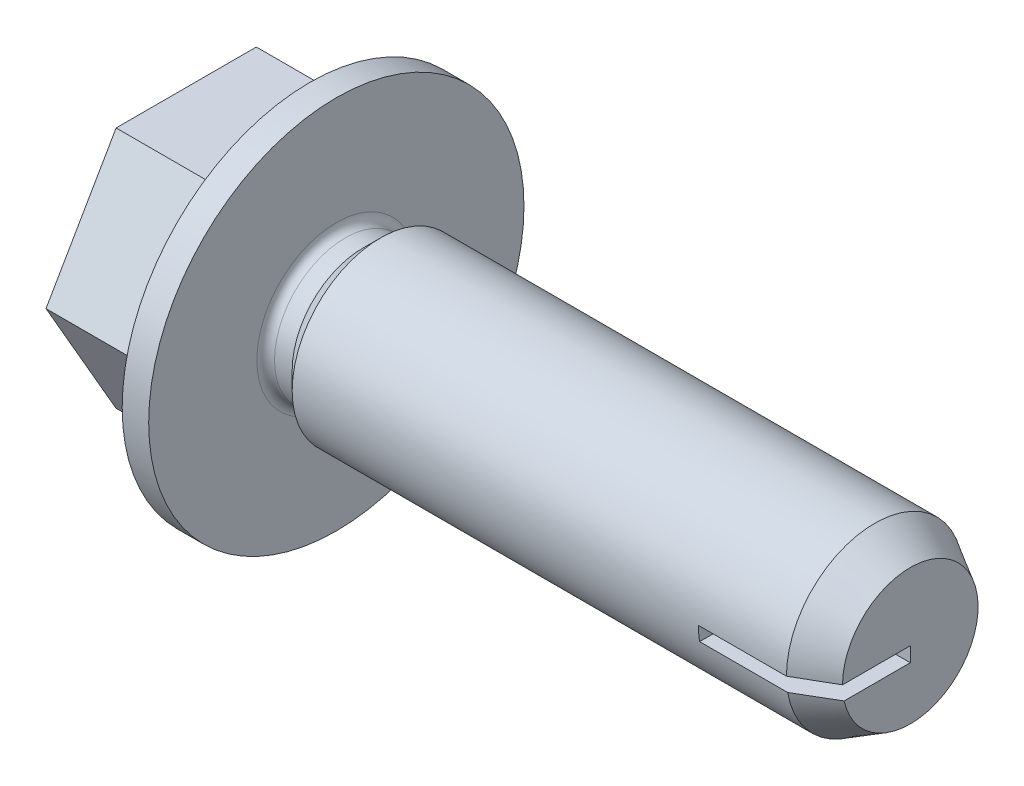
ISO-10303-21;
HEADER;
FILE_DESCRIPTION(('STEP AP214'),'2;1');
FILE_NAME('part.step','',(''),(''),'','','');
FILE_SCHEMA(('AUTOMOTIVE_DESIGN { 1 0 10303 214 1 1 1 1 }'));
ENDSEC;
DATA;
#1=APPLICATION_CONTEXT('core data for automotive mechanical design processes');
#2=APPLICATION_PROTOCOL_DEFINITION('international standard','automotive_design',2000,#1);
#3=PRODUCT_CONTEXT('',#1,'mechanical');
#4=PRODUCT('Part','Part','',(#3));
#5=PRODUCT_RELATED_PRODUCT_CATEGORY('part','',(#4));
#6=PRODUCT_DEFINITION_FORMATION('','',#4);
#7=PRODUCT_DEFINITION_CONTEXT('part definition',#1,'design');
#8=PRODUCT_DEFINITION('design','',#6,#7);
#9=PRODUCT_DEFINITION_SHAPE('','',#8);
#10=(LENGTH_UNIT() NAMED_UNIT(*) SI_UNIT(.MILLI.,.METRE.));
#11=(NAMED_UNIT(*) PLANE_ANGLE_UNIT() SI_UNIT($,.RADIAN.));
#12=(NAMED_UNIT(*) SI_UNIT($,.STERADIAN.) SOLID_ANGLE_UNIT());
#13=UNCERTAINTY_MEASURE_WITH_UNIT(LENGTH_MEASURE(1.E-05),#10,'distance_accuracy_value','');
#14=(GEOMETRIC_REPRESENTATION_CONTEXT(3) GLOBAL_UNCERTAINTY_ASSIGNED_CONTEXT((#13)) GLOBAL_UNIT_ASSIGNED_CONTEXT((#10,
#11,#12)) REPRESENTATION_CONTEXT('',''));
#15=CARTESIAN_POINT('',(0.,0.,0.));
#16=DIRECTION('',(0.,0.,1.));
#17=DIRECTION('',(1.,0.,0.));
#18=AXIS2_PLACEMENT_3D('',#15,#16,#17);
#19=CARTESIAN_POINT('',(0.,0.,0.));
#20=DIRECTION('',(-1.,0.,0.));
#21=DIRECTION('',(0.,0.,1.));
#22=AXIS2_PLACEMENT_3D('',#19,#20,#21);
#23=CYLINDRICAL_SURFACE('',#22,2.);
#24=CARTESIAN_POINT('',(1.,0.,0.));
#25=DIRECTION('',(-1.,0.,0.));
#26=DIRECTION('',(0.,0.,1.));
#27=AXIS2_PLACEMENT_3D('',#24,#25,#26);
#28=CIRCLE('',#27,2.);
#29=CARTESIAN_POINT('',(1.,0.,2.));
#30=VERTEX_POINT('',#29);
#31=EDGE_CURVE('E256',#30,#30,#28,.T.);
#32=ORIENTED_EDGE('',*,*,#31,.F.);
#33=EDGE_LOOP('',(#32));
#34=FACE_BOUND('',#33,.T.);
#35=DIRECTION('',(-1.,0.,0.));
#36=VECTOR('',#35,1.);
#37=CARTESIAN_POINT('',(0.,0.,2.));
#38=LINE('',#37,#36);
#39=CARTESIAN_POINT('',(12.1945963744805,0.,2.));
#40=VERTEX_POINT('',#39);
#41=CARTESIAN_POINT('',(10.2,0.,2.));
#42=VERTEX_POINT('',#41);
#43=EDGE_CURVE('E392',#40,#42,#38,.T.);
#44=ORIENTED_EDGE('',*,*,#43,.F.);
#45=CARTESIAN_POINT('',(12.1945963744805,0.,0.));
#46=DIRECTION('',(-1.,0.,0.));
#47=DIRECTION('',(0.,0.,1.));
#48=AXIS2_PLACEMENT_3D('',#45,#46,#47);
#49=CIRCLE('',#48,2.);
#50=CARTESIAN_POINT('',(12.1945963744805,-0.333333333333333,1.97202659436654));
#51=VERTEX_POINT('',#50);
#52=EDGE_CURVE('E387',#40,#51,#49,.T.);
#53=ORIENTED_EDGE('',*,*,#52,.T.);
#54=DIRECTION('',(-1.,0.,0.));
#55=VECTOR('',#54,1.);
#56=CARTESIAN_POINT('',(0.,-0.333333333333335,1.97202659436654));
#57=LINE('',#56,#55);
#58=CARTESIAN_POINT('',(10.2,-0.333333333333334,1.97202659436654));
#59=VERTEX_POINT('',#58);
#60=EDGE_CURVE('E396',#59,#51,#57,.F.);
#61=ORIENTED_EDGE('',*,*,#60,.F.);
#62=CARTESIAN_POINT('',(10.2,0.,0.));
#63=DIRECTION('',(1.,0.,0.));
#64=DIRECTION('',(0.,0.,-1.));
#65=AXIS2_PLACEMENT_3D('',#62,#63,#64);
#66=CIRCLE('',#65,2.);
#67=EDGE_CURVE('E125',#42,#59,#66,.T.);
#68=ORIENTED_EDGE('',*,*,#67,.F.);
#69=EDGE_LOOP('',(#44,#53,#61,#68));
#70=FACE_BOUND('',#69,.T.);
#71=ADVANCED_FACE('F151',(#34,#70),#23,.T.);
#72=CARTESIAN_POINT('',(12.1945963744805,0.,0.));
#73=DIRECTION('',(-1.,0.,0.));
#74=DIRECTION('',(0.,0.,1.));
#75=AXIS2_PLACEMENT_3D('',#72,#73,#74);
#76=CONICAL_SURFACE('',#75,2.,0.523598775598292);
#77=ORIENTED_EDGE('',*,*,#52,.F.);
#78=DIRECTION('',(-0.866025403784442,0.,0.499999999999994));
#79=VECTOR('',#78,1.);
#80=CARTESIAN_POINT('',(15.6586979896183,0.,0.));
#81=LINE('',#80,#79);
#82=CARTESIAN_POINT('',(13.,0.,1.535));
#83=VERTEX_POINT('',#82);
#84=EDGE_CURVE('E394',#40,#83,#81,.F.);
#85=ORIENTED_EDGE('',*,*,#84,.T.);
#86=CARTESIAN_POINT('',(13.,0.,0.));
#87=DIRECTION('',(-1.,0.,0.));
#88=DIRECTION('',(0.,0.,1.));
#89=AXIS2_PLACEMENT_3D('',#86,#87,#88);
#90=CIRCLE('',#89,1.535);
#91=CARTESIAN_POINT('',(13.,-0.333333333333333,1.49837041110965));
#92=VERTEX_POINT('',#91);
#93=EDGE_CURVE('E254',#83,#92,#90,.T.);
#94=ORIENTED_EDGE('',*,*,#93,.T.);
#95=CARTESIAN_POINT('',(14.7245765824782,-0.333333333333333,0.423969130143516));
#96=CARTESIAN_POINT('',(14.7003740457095,-0.333333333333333,0.441731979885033));
#97=CARTESIAN_POINT('',(14.6759825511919,-0.333333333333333,0.459232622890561));
#98=CARTESIAN_POINT('',(14.6269078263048,-0.333333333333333,0.49381503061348));
#99=CARTESIAN_POINT('',(14.6022246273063,-0.333333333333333,0.510896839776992));
#100=CARTESIAN_POINT('',(14.5278722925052,-0.333333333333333,0.561668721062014));
#101=CARTESIAN_POINT('',(14.4778872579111,-0.333333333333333,0.594894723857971));
#102=CARTESIAN_POINT('',(14.3774348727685,-0.333333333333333,0.660556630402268));
#103=CARTESIAN_POINT('',(14.3269677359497,-0.333333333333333,0.692992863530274));
#104=CARTESIAN_POINT('',(14.2256954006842,-0.333333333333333,0.757342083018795));
#105=CARTESIAN_POINT('',(14.1748901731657,-0.333333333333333,0.789255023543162));
#106=CARTESIAN_POINT('',(14.0279577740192,-0.333333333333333,0.880817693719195));
#107=CARTESIAN_POINT('',(13.9315407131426,-0.333333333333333,0.940001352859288));
#108=CARTESIAN_POINT('',(13.7382584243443,-0.333333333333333,1.0576330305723));
#109=CARTESIAN_POINT('',(13.6413931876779,-0.333333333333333,1.11608103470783));
#110=CARTESIAN_POINT('',(13.3503178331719,-0.333333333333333,1.29078741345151));
#111=CARTESIAN_POINT('',(13.1556992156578,-0.333333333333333,1.40636454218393));
#112=CARTESIAN_POINT('',(12.8117855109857,-0.333333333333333,1.60961313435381));
#113=CARTESIAN_POINT('',(12.6625918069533,-0.333333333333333,1.69745704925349));
#114=CARTESIAN_POINT('',(12.3640150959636,-0.333333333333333,1.87282276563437));
#115=CARTESIAN_POINT('',(12.2146320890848,-0.333333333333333,1.96034456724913));
#116=CARTESIAN_POINT('',(11.9158541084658,-0.333333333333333,2.1351138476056));
#117=CARTESIAN_POINT('',(11.7664592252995,-0.333333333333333,2.22236148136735));
#118=CARTESIAN_POINT('',(11.467580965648,-0.333333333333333,2.3967043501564));
#119=CARTESIAN_POINT('',(11.318097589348,-0.333333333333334,2.48379958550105));
#120=CARTESIAN_POINT('',(11.1685865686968,-0.333333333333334,2.5708472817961));
#121=B_SPLINE_CURVE_WITH_KNOTS('',3,(#95,#96,#97,#98,#99,#100,#101,#102,#103,#104,#105,#106,
#107,#108,#109,#110,#111,#112,#113,#114,#115,#116,#117,#118,#119,#120),.UNSPECIFIED.,.F.,.F.,(4,
2,2,2,2,2,2,2,2,2,2,2,4),(0.,0.0900582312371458,0.180106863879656,0.360155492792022,
0.540127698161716,0.720115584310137,1.05950608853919,1.39890324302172,2.07794788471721,
2.59734938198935,3.11675066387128,3.63576777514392,4.15478380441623),.UNSPECIFIED.);
#122=EDGE_CURVE('E398',#92,#51,#121,.T.);
#123=ORIENTED_EDGE('',*,*,#122,.T.);
#124=EDGE_LOOP('',(#77,#85,#94,#123));
#125=FACE_BOUND('',#124,.T.);
#126=ADVANCED_FACE('F406',(#125),#76,.T.);
#127=CARTESIAN_POINT('',(13.,2.00000000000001,0.));
#128=DIRECTION('',(-1.,0.,0.));
#129=DIRECTION('',(0.,0.,1.));
#130=AXIS2_PLACEMENT_3D('',#127,#128,#129);
#131=PLANE('',#130);
#132=DIRECTION('',(0.,0.,1.));
#133=VECTOR('',#132,1.);
#134=CARTESIAN_POINT('',(13.,0.,0.));
#135=LINE('',#134,#133);
#136=CARTESIAN_POINT('',(13.,0.,0.));
#137=VERTEX_POINT('',#136);
#138=EDGE_CURVE('E159',#137,#83,#135,.T.);
#139=ORIENTED_EDGE('',*,*,#138,.F.);
#140=DIRECTION('',(0.,1.,0.));
#141=VECTOR('',#140,1.);
#142=CARTESIAN_POINT('',(13.,0.,0.));
#143=LINE('',#142,#141);
#144=CARTESIAN_POINT('',(13.,-0.333333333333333,0.));
#145=VERTEX_POINT('',#144);
#146=EDGE_CURVE('E243',#145,#137,#143,.T.);
#147=ORIENTED_EDGE('',*,*,#146,.F.);
#148=DIRECTION('',(0.,0.,-1.));
#149=VECTOR('',#148,1.);
#150=CARTESIAN_POINT('',(13.,-0.333333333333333,0.));
#151=LINE('',#150,#149);
#152=EDGE_CURVE('E255',#92,#145,#151,.T.);
#153=ORIENTED_EDGE('',*,*,#152,.F.);
#154=ORIENTED_EDGE('',*,*,#93,.F.);
#155=EDGE_LOOP('',(#139,#147,#153,#154));
#156=FACE_BOUND('',#155,.T.);
#157=ADVANCED_FACE('F252',(#156),#131,.F.);
#158=CARTESIAN_POINT('',(-3.4,2.75,0.));
#159=DIRECTION('',(1.,0.,0.));
#160=DIRECTION('',(0.,0.,-1.));
#161=AXIS2_PLACEMENT_3D('',#158,#159,#160);
#162=PLANE('',#161);
#163=CARTESIAN_POINT('',(-3.4,0.,0.));
#164=DIRECTION('',(-1.,0.,0.));
#165=DIRECTION('',(0.,0.,1.));
#166=AXIS2_PLACEMENT_3D('',#163,#164,#165);
#167=CIRCLE('',#166,2.2);
#168=CARTESIAN_POINT('',(-3.4,0.,2.2));
#169=VERTEX_POINT('',#168);
#170=EDGE_CURVE('E446',#169,#169,#167,.T.);
#171=ORIENTED_EDGE('',*,*,#170,.F.);
#172=EDGE_LOOP('',(#171));
#173=FACE_BOUND('',#172,.T.);
#174=DIRECTION('',(0.,-0.866025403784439,-0.5));
#175=VECTOR('',#174,1.);
#176=CARTESIAN_POINT('',(-3.4,1.375,-2.38156986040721));
#177=LINE('',#176,#175);
#178=CARTESIAN_POINT('',(-3.4,2.75,-1.58771324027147));
#179=VERTEX_POINT('',#178);
#180=CARTESIAN_POINT('',(-3.4,0.,-3.17542648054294));
#181=VERTEX_POINT('',#180);
#182=EDGE_CURVE('E279',#179,#181,#177,.T.);
#183=ORIENTED_EDGE('',*,*,#182,.T.);
#184=DIRECTION('',(0.,-0.866025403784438,0.5));
#185=VECTOR('',#184,1.);
#186=CARTESIAN_POINT('',(-3.4,-1.375,-2.38156986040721));
#187=LINE('',#186,#185);
#188=CARTESIAN_POINT('',(-3.4,-2.75,-1.58771324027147));
#189=VERTEX_POINT('',#188);
#190=EDGE_CURVE('E353',#181,#189,#187,.T.);
#191=ORIENTED_EDGE('',*,*,#190,.T.);
#192=DIRECTION('',(0.,0.,1.));
#193=VECTOR('',#192,1.);
#194=CARTESIAN_POINT('',(-3.4,-2.75,0.));
#195=LINE('',#194,#193);
#196=CARTESIAN_POINT('',(-3.4,-2.75,1.58771324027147));
#197=VERTEX_POINT('',#196);
#198=EDGE_CURVE('E382',#189,#197,#195,.T.);
#199=ORIENTED_EDGE('',*,*,#198,.T.);
#200=DIRECTION('',(0.,0.866025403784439,0.5));
#201=VECTOR('',#200,1.);
#202=CARTESIAN_POINT('',(-3.4,-2.75,1.58771324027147));
#203=LINE('',#202,#201);
#204=CARTESIAN_POINT('',(-3.4,0.,3.17542648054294));
#205=VERTEX_POINT('',#204);
#206=EDGE_CURVE('E351',#197,#205,#203,.T.);
#207=ORIENTED_EDGE('',*,*,#206,.T.);
#208=DIRECTION('',(0.,0.866025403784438,-0.5));
#209=VECTOR('',#208,1.);
#210=CARTESIAN_POINT('',(-3.4,0.,3.17542648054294));
#211=LINE('',#210,#209);
#212=CARTESIAN_POINT('',(-3.4,2.75,1.58771324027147));
#213=VERTEX_POINT('',#212);
#214=EDGE_CURVE('E321',#205,#213,#211,.T.);
#215=ORIENTED_EDGE('',*,*,#214,.T.);
#216=DIRECTION('',(0.,0.,-1.));
#217=VECTOR('',#216,1.);
#218=CARTESIAN_POINT('',(-3.4,2.75,0.));
#219=LINE('',#218,#217);
#220=EDGE_CURVE('E276',#213,#179,#219,.T.);
#221=ORIENTED_EDGE('',*,*,#220,.T.);
#222=EDGE_LOOP('',(#183,#191,#199,#207,#215,#221));
#223=FACE_BOUND('',#222,.T.);
#224=ADVANCED_FACE('F153',(#173,#223),#162,.F.);
#225=CARTESIAN_POINT('',(1.,0.,0.));
#226=DIRECTION('',(1.,0.,0.));
#227=DIRECTION('',(0.,0.,-1.));
#228=AXIS2_PLACEMENT_3D('',#225,#226,#227);
#229=CONICAL_SURFACE('',#228,2.,0.785398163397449);
#230=CARTESIAN_POINT('',(0.599999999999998,0.,0.));
#231=DIRECTION('',(-1.,0.,0.));
#232=DIRECTION('',(0.,0.,1.));
#233=AXIS2_PLACEMENT_3D('',#230,#231,#232);
#234=CIRCLE('',#233,1.6);
#235=CARTESIAN_POINT('',(0.599999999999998,0.,1.6));
#236=VERTEX_POINT('',#235);
#237=EDGE_CURVE('E261',#236,#236,#234,.T.);
#238=ORIENTED_EDGE('',*,*,#237,.F.);
#239=EDGE_LOOP('',(#238));
#240=FACE_BOUND('',#239,.T.);
#241=ORIENTED_EDGE('',*,*,#31,.T.);
#242=EDGE_LOOP('',(#241));
#243=FACE_BOUND('',#242,.T.);
#244=ADVANCED_FACE('F432',(#240,#243),#229,.T.);
#245=CARTESIAN_POINT('',(0.,0.,0.));
#246=DIRECTION('',(-1.,0.,0.));
#247=DIRECTION('',(0.,0.,1.));
#248=AXIS2_PLACEMENT_3D('',#245,#246,#247);
#249=CYLINDRICAL_SURFACE('',#248,1.6);
#250=CARTESIAN_POINT('',(0.2,0.,0.));
#251=DIRECTION('',(-1.,0.,0.));
#252=DIRECTION('',(0.,0.,1.));
#253=AXIS2_PLACEMENT_3D('',#250,#251,#252);
#254=CIRCLE('',#253,1.6);
#255=CARTESIAN_POINT('',(0.2,0.,1.6));
#256=VERTEX_POINT('',#255);
#257=EDGE_CURVE('E264',#256,#256,#254,.T.);
#258=ORIENTED_EDGE('',*,*,#257,.F.);
#259=EDGE_LOOP('',(#258));
#260=FACE_BOUND('',#259,.T.);
#261=ORIENTED_EDGE('',*,*,#237,.T.);
#262=EDGE_LOOP('',(#261));
#263=FACE_BOUND('',#262,.T.);
#264=ADVANCED_FACE('F442',(#260,#263),#249,.T.);
#265=CARTESIAN_POINT('',(0.2,0.,0.));
#266=DIRECTION('',(-1.,0.,0.));
#267=DIRECTION('',(0.,0.,1.));
#268=AXIS2_PLACEMENT_3D('',#265,#266,#267);
#269=TOROIDAL_SURFACE('',#268,1.8,0.2);
#270=CARTESIAN_POINT('',(0.,0.,0.));
#271=DIRECTION('',(-1.,0.,0.));
#272=DIRECTION('',(0.,0.,1.));
#273=AXIS2_PLACEMENT_3D('',#270,#271,#272);
#274=CIRCLE('',#273,1.8);
#275=CARTESIAN_POINT('',(0.,0.,1.8));
#276=VERTEX_POINT('',#275);
#277=EDGE_CURVE('E267',#276,#276,#274,.T.);
#278=ORIENTED_EDGE('',*,*,#277,.F.);
#279=EDGE_LOOP('',(#278));
#280=FACE_BOUND('',#279,.T.);
#281=ORIENTED_EDGE('',*,*,#257,.T.);
#282=EDGE_LOOP('',(#281));
#283=FACE_BOUND('',#282,.T.);
#284=ADVANCED_FACE('F580',(#280,#283),#269,.F.);
#285=CARTESIAN_POINT('',(0.,4.25,0.));
#286=DIRECTION('',(-1.,0.,0.));
#287=DIRECTION('',(0.,0.,1.));
#288=AXIS2_PLACEMENT_3D('',#285,#286,#287);
#289=PLANE('',#288);
#290=CARTESIAN_POINT('',(0.,0.,0.));
#291=DIRECTION('',(-1.,0.,0.));
#292=DIRECTION('',(0.,0.,1.));
#293=AXIS2_PLACEMENT_3D('',#290,#291,#292);
#294=CIRCLE('',#293,4.25);
#295=CARTESIAN_POINT('',(0.,0.,4.25));
#296=VERTEX_POINT('',#295);
#297=EDGE_CURVE('E270',#296,#296,#294,.T.);
#298=ORIENTED_EDGE('',*,*,#297,.F.);
#299=EDGE_LOOP('',(#298));
#300=FACE_BOUND('',#299,.T.);
#301=ORIENTED_EDGE('',*,*,#277,.T.);
#302=EDGE_LOOP('',(#301));
#303=FACE_BOUND('',#302,.T.);
#304=ADVANCED_FACE('F570',(#300,#303),#289,.F.);
#305=CARTESIAN_POINT('',(0.,0.,0.));
#306=DIRECTION('',(-1.,0.,0.));
#307=DIRECTION('',(0.,0.,1.));
#308=AXIS2_PLACEMENT_3D('',#305,#306,#307);
#309=CYLINDRICAL_SURFACE('',#308,4.25);
#310=CARTESIAN_POINT('',(-0.6,0.,0.));
#311=DIRECTION('',(-1.,0.,0.));
#312=DIRECTION('',(0.,0.,1.));
#313=AXIS2_PLACEMENT_3D('',#310,#311,#312);
#314=CIRCLE('',#313,4.25);
#315=CARTESIAN_POINT('',(-0.6,0.,4.25));
#316=VERTEX_POINT('',#315);
#317=EDGE_CURVE('E273',#316,#316,#314,.T.);
#318=ORIENTED_EDGE('',*,*,#317,.F.);
#319=EDGE_LOOP('',(#318));
#320=FACE_BOUND('',#319,.T.);
#321=ORIENTED_EDGE('',*,*,#297,.T.);
#322=EDGE_LOOP('',(#321));
#323=FACE_BOUND('',#322,.T.);
#324=ADVANCED_FACE('F560',(#320,#323),#309,.T.);
#325=CARTESIAN_POINT('',(-0.6,0.,0.));
#326=DIRECTION('',(1.,0.,0.));
#327=DIRECTION('',(0.,0.,-1.));
#328=AXIS2_PLACEMENT_3D('',#325,#326,#327);
#329=CONICAL_SURFACE('',#328,4.25,1.25663706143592);
#330=CARTESIAN_POINT('',(-0.949112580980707,0.000199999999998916,-3.17554195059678));
#331=CARTESIAN_POINT('',(-0.97051234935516,-0.113823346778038,-3.10971054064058));
#332=CARTESIAN_POINT('',(-0.989962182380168,-0.228148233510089,-3.04370503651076));
#333=CARTESIAN_POINT('',(-1.02416112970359,-0.457390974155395,-2.91135167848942));
#334=CARTESIAN_POINT('',(-1.03890736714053,-0.572309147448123,-2.84500364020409));
#335=CARTESIAN_POINT('',(-1.06277959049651,-0.801718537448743,-2.7125540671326));
#336=CARTESIAN_POINT('',(-1.07194722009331,-0.916206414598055,-2.6464544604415));
#337=CARTESIAN_POINT('',(-1.08424450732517,-1.14539621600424,-2.51413166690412));
#338=CARTESIAN_POINT('',(-1.08737593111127,-1.26009806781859,-2.44790852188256));
#339=CARTESIAN_POINT('',(-1.08738315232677,-1.48953500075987,-2.31544304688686));
#340=CARTESIAN_POINT('',(-1.0842571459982,-1.60427008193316,-2.24920071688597));
#341=CARTESIAN_POINT('',(-1.07196681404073,-1.83352641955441,-2.11683950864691));
#342=CARTESIAN_POINT('',(-1.06280071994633,-1.94804760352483,-2.05072067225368));
#343=CARTESIAN_POINT('',(-1.03892796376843,-2.17752392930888,-1.91823245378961));
#344=CARTESIAN_POINT('',(-1.02417961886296,-2.29247572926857,-1.85186500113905));
#345=CARTESIAN_POINT('',(-0.989973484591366,-2.52178538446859,-1.71947300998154));
#346=CARTESIAN_POINT('',(-0.970518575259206,-2.63614355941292,-1.65344828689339));
#347=CARTESIAN_POINT('',(-0.949112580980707,-2.7502,-1.58759777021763));
#348=B_SPLINE_CURVE_WITH_KNOTS('',3,(#330,#331,#332,#333,#334,#335,#336,#337,#338,#339,#340,
#341,#342,#343,#344,#345,#346,#347),.UNSPECIFIED.,.F.,.F.,(4,2,2,2,2,2,2,2,4),(0.,
0.400203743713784,0.800651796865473,1.19807265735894,1.59537721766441,1.99279632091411,
2.3903318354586,2.79089627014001,3.19121620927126),.UNSPECIFIED.);
#349=CARTESIAN_POINT('',(-0.949150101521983,0.,-3.17542648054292));
#350=VERTEX_POINT('',#349);
#351=CARTESIAN_POINT('',(-0.949150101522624,-2.75,-1.58771324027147));
#352=VERTEX_POINT('',#351);
#353=EDGE_CURVE('E314',#350,#352,#348,.T.);
#354=ORIENTED_EDGE('',*,*,#353,.F.);
#355=CARTESIAN_POINT('',(-0.949112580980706,2.7502,-1.58759777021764));
#356=CARTESIAN_POINT('',(-0.970518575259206,2.63614355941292,-1.6534482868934));
#357=CARTESIAN_POINT('',(-0.989973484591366,2.52178538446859,-1.71947300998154));
#358=CARTESIAN_POINT('',(-1.02417961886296,2.29247572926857,-1.85186500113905));
#359=CARTESIAN_POINT('',(-1.03892796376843,2.17752392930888,-1.91823245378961));
#360=CARTESIAN_POINT('',(-1.06280071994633,1.94804760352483,-2.05072067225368));
#361=CARTESIAN_POINT('',(-1.07196681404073,1.83352641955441,-2.11683950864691));
#362=CARTESIAN_POINT('',(-1.0842571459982,1.60427008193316,-2.24920071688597));
#363=CARTESIAN_POINT('',(-1.08738315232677,1.48953500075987,-2.31544304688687));
#364=CARTESIAN_POINT('',(-1.08737593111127,1.26009806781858,-2.44790852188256));
#365=CARTESIAN_POINT('',(-1.08424450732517,1.14539621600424,-2.51413166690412));
#366=CARTESIAN_POINT('',(-1.07194722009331,0.916206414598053,-2.6464544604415));
#367=CARTESIAN_POINT('',(-1.06277959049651,0.801718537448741,-2.7125540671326));
#368=CARTESIAN_POINT('',(-1.03890736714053,0.572309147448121,-2.84500364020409));
#369=CARTESIAN_POINT('',(-1.02416112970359,0.457390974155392,-2.91135167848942));
#370=CARTESIAN_POINT('',(-0.989962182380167,0.228148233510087,-3.04370503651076));
#371=CARTESIAN_POINT('',(-0.97051234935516,0.113823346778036,-3.10971054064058));
#372=CARTESIAN_POINT('',(-0.949112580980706,-0.000200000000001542,-3.17554195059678));
#373=B_SPLINE_CURVE_WITH_KNOTS('',3,(#355,#356,#357,#358,#359,#360,#361,#362,#363,#364,#365,
#366,#367,#368,#369,#370,#371,#372),.UNSPECIFIED.,.F.,.F.,(4,2,2,2,2,2,2,2,4),(0.,
0.400319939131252,0.800884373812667,1.19841988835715,1.59583899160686,1.99314355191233,
2.39056441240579,2.79101246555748,3.19121620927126),.UNSPECIFIED.);
#374=CARTESIAN_POINT('',(-0.949150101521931,2.7499999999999,-1.58771324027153));
#375=VERTEX_POINT('',#374);
#376=EDGE_CURVE('E174',#375,#350,#373,.T.);
#377=ORIENTED_EDGE('',*,*,#376,.F.);
#378=CARTESIAN_POINT('',(0.636777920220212,2.75,7.57253318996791));
#379=CARTESIAN_POINT('',(0.565102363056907,2.75,7.33778808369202));
#380=CARTESIAN_POINT('',(0.493752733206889,2.75,7.10294228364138));
#381=CARTESIAN_POINT('',(0.351978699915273,2.75,6.63295914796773));
#382=CARTESIAN_POINT('',(0.281554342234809,2.75,6.39782179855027));
#383=CARTESIAN_POINT('',(0.141788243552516,2.75,5.92677365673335));
#384=CARTESIAN_POINT('',(0.0724486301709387,2.75,5.69086223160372));
#385=CARTESIAN_POINT('',(-0.0645816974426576,2.75,5.21856712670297));
#386=CARTESIAN_POINT('',(-0.132272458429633,2.75,4.98218346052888));
#387=CARTESIAN_POINT('',(-0.266126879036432,2.75,4.50605644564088));
#388=CARTESIAN_POINT('',(-0.332264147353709,2.75,4.26630564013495));
#389=CARTESIAN_POINT('',(-0.46116101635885,2.75,3.78590032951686));
#390=CARTESIAN_POINT('',(-0.523920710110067,2.75,3.54524584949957));
#391=CARTESIAN_POINT('',(-0.644435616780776,2.75,3.06271156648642));
#392=CARTESIAN_POINT('',(-0.702191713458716,2.75,2.82083198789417));
#393=CARTESIAN_POINT('',(-0.783088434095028,2.75,2.45675003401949));
#394=CARTESIAN_POINT('',(-0.809095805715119,2.75,2.33518932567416));
#395=CARTESIAN_POINT('',(-0.858726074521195,2.75,2.09158323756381));
#396=CARTESIAN_POINT('',(-0.882348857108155,2.75,1.96953783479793));
#397=CARTESIAN_POINT('',(-0.953290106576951,2.75,1.57799575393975));
#398=CARTESIAN_POINT('',(-0.995005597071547,2.75,1.30739545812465));
#399=CARTESIAN_POINT('',(-1.04166412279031,2.75,0.899842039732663));
#400=CARTESIAN_POINT('',(-1.0545615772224,2.75,0.763796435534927));
#401=CARTESIAN_POINT('',(-1.07426058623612,2.75,0.491257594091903));
#402=CARTESIAN_POINT('',(-1.08106243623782,2.75,0.354764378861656));
#403=CARTESIAN_POINT('',(-1.08806422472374,2.75,0.0822529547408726));
#404=CARTESIAN_POINT('',(-1.0882952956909,2.75,-0.0537644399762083));
#405=CARTESIAN_POINT('',(-1.08221660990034,2.75,-0.325652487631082));
#406=CARTESIAN_POINT('',(-1.07590671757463,2.75,-0.461523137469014));
#407=CARTESIAN_POINT('',(-1.05719217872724,2.75,-0.73297484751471));
#408=CARTESIAN_POINT('',(-1.04478127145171,2.75,-0.868555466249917));
#409=CARTESIAN_POINT('',(-1.01463793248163,2.75,-1.13912649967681));
#410=CARTESIAN_POINT('',(-0.996904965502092,2.75,-1.27411685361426));
#411=CARTESIAN_POINT('',(-0.957377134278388,2.75,-1.54094768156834));
#412=CARTESIAN_POINT('',(-0.935663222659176,2.75,-1.6728003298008));
#413=CARTESIAN_POINT('',(-0.88877091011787,2.75,-1.93588019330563));
#414=CARTESIAN_POINT('',(-0.863592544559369,2.75,-2.06710741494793));
#415=CARTESIAN_POINT('',(-0.810467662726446,2.75,-2.32897928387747));
#416=CARTESIAN_POINT('',(-0.782521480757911,2.75,-2.45962399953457));
#417=CARTESIAN_POINT('',(-0.724423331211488,2.75,-2.72042189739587));
#418=CARTESIAN_POINT('',(-0.694271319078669,2.75,-2.85057506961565));
#419=CARTESIAN_POINT('',(-0.63188737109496,2.75,-3.11181191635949));
#420=CARTESIAN_POINT('',(-0.599637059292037,2.75,-3.24289118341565));
#421=CARTESIAN_POINT('',(-0.533702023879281,2.75,-3.50468850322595));
#422=CARTESIAN_POINT('',(-0.500017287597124,2.75,-3.63540655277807));
#423=CARTESIAN_POINT('',(-0.431528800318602,2.75,-3.89641316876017));
#424=CARTESIAN_POINT('',(-0.396726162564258,2.75,-4.02670202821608));
#425=CARTESIAN_POINT('',(-0.326178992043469,2.75,-4.28701801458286));
#426=CARTESIAN_POINT('',(-0.290434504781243,2.75,-4.41704515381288));
#427=CARTESIAN_POINT('',(-0.254321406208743,2.75,-4.54696818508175));
#428=B_SPLINE_CURVE_WITH_KNOTS('',3,(#378,#379,#380,#381,#382,#383,#384,#385,#386,#387,#388,
#389,#390,#391,#392,#393,#394,#395,#396,#397,#398,#399,#400,#401,#402,#403,#404,#405,#406,#407,
#408,#409,#410,#411,#412,#413,#414,#415,#416,#417,#418,#419,#420,#421,#422,#423,#424,#425,#426,
#427),.UNSPECIFIED.,.F.,.F.,(4,2,2,2,2,2,2,2,2,2,2,2,2,2,2,2,2,2,2,2,2,2,2,2,4),(0.,
0.736332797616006,1.4727018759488,2.21036921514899,2.94801561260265,3.69411562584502,
4.44019507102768,5.18614247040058,5.55905285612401,5.9319811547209,6.75266052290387,
7.16251520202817,7.57235001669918,7.98024270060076,8.38814383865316,8.79646443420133,
9.20482611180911,9.60565574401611,10.0064812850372,10.4072584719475,10.8080437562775,
11.2129988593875,11.617957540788,12.0225247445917,12.4270724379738),.UNSPECIFIED.);
#429=CARTESIAN_POINT('',(-0.949150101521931,2.75,1.58771324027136));
#430=VERTEX_POINT('',#429);
#431=EDGE_CURVE('E289',#430,#375,#428,.T.);
#432=ORIENTED_EDGE('',*,*,#431,.F.);
#433=CARTESIAN_POINT('',(-0.949112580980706,-0.000199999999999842,3.17554195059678));
#434=CARTESIAN_POINT('',(-0.970515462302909,0.113839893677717,3.1097009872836));
#435=CARTESIAN_POINT('',(-0.989967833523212,0.228181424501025,3.04368587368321));
#436=CARTESIAN_POINT('',(-1.02417037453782,0.457457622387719,2.91131319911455));
#437=CARTESIAN_POINT('',(-1.03891766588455,0.572392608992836,2.84495545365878));
#438=CARTESIAN_POINT('',(-1.06279015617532,0.801835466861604,2.71248655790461));
#439=CARTESIAN_POINT('',(-1.07195701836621,0.916339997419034,2.64637733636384));
#440=CARTESIAN_POINT('',(-1.08425082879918,1.14556306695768,2.51403533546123));
#441=CARTESIAN_POINT('',(-1.08737954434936,1.26028153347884,2.44780259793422));
#442=CARTESIAN_POINT('',(-1.08737954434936,1.48971846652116,2.31533712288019));
#443=CARTESIAN_POINT('',(-1.08425082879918,1.60443693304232,2.24910438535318));
#444=CARTESIAN_POINT('',(-1.07195701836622,1.83366000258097,2.11676238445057));
#445=CARTESIAN_POINT('',(-1.06279015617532,1.9481645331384,2.05065316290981));
#446=CARTESIAN_POINT('',(-1.03891766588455,2.17760739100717,1.91818426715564));
#447=CARTESIAN_POINT('',(-1.02417037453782,2.29254237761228,1.85182652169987));
#448=CARTESIAN_POINT('',(-0.989967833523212,2.52181857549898,1.71945384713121));
#449=CARTESIAN_POINT('',(-0.97051546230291,2.63616010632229,1.65343873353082));
#450=CARTESIAN_POINT('',(-0.949112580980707,2.7502,1.58759777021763));
#451=B_SPLINE_CURVE_WITH_KNOTS('',3,(#433,#434,#435,#436,#437,#438,#439,#440,#441,#442,#443,
#444,#445,#446,#447,#448,#449,#450),.UNSPECIFIED.,.F.,.F.,(4,2,2,2,2,2,2,2,4),(0.,
0.400261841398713,0.800768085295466,1.1982462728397,1.59560810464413,1.99296993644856,
2.3904481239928,2.79095436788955,3.19121620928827),.UNSPECIFIED.);
#452=CARTESIAN_POINT('',(-0.949150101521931,0.,3.17542648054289));
#453=VERTEX_POINT('',#452);
#454=EDGE_CURVE('E306',#453,#430,#451,.T.);
#455=ORIENTED_EDGE('',*,*,#454,.F.);
#456=CARTESIAN_POINT('',(-0.949112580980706,-2.7502,1.58759777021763));
#457=CARTESIAN_POINT('',(-0.97051546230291,-2.63616010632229,1.65343873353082));
#458=CARTESIAN_POINT('',(-0.989967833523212,-2.52181857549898,1.71945384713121));
#459=CARTESIAN_POINT('',(-1.02417037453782,-2.29254237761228,1.85182652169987));
#460=CARTESIAN_POINT('',(-1.03891766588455,-2.17760739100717,1.91818426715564));
#461=CARTESIAN_POINT('',(-1.06279015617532,-1.9481645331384,2.05065316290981));
#462=CARTESIAN_POINT('',(-1.07195701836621,-1.83366000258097,2.11676238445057));
#463=CARTESIAN_POINT('',(-1.08425082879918,-1.60443693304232,2.24910438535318));
#464=CARTESIAN_POINT('',(-1.08737954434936,-1.48971846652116,2.3153371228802));
#465=CARTESIAN_POINT('',(-1.08737954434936,-1.26028153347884,2.44780259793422));
#466=CARTESIAN_POINT('',(-1.08425082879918,-1.14556306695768,2.51403533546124));
#467=CARTESIAN_POINT('',(-1.07195701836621,-0.916339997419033,2.64637733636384));
#468=CARTESIAN_POINT('',(-1.06279015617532,-0.801835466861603,2.71248655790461));
#469=CARTESIAN_POINT('',(-1.03891766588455,-0.572392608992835,2.84495545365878));
#470=CARTESIAN_POINT('',(-1.02417037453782,-0.457457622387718,2.91131319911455));
#471=CARTESIAN_POINT('',(-0.989967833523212,-0.228181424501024,3.04368587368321));
#472=CARTESIAN_POINT('',(-0.97051546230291,-0.113839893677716,3.1097009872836));
#473=CARTESIAN_POINT('',(-0.949112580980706,0.000200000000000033,3.17554195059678));
#474=B_SPLINE_CURVE_WITH_KNOTS('',3,(#456,#457,#458,#459,#460,#461,#462,#463,#464,#465,#466,
#467,#468,#469,#470,#471,#472,#473),.UNSPECIFIED.,.F.,.F.,(4,2,2,2,2,2,2,2,4),(0.,
0.400261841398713,0.800768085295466,1.1982462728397,1.59560810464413,1.99296993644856,
2.3904481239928,2.79095436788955,3.19121620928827),.UNSPECIFIED.);
#475=CARTESIAN_POINT('',(-0.949150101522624,-2.75,1.58771324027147));
#476=VERTEX_POINT('',#475);
#477=EDGE_CURVE('E344',#476,#453,#474,.T.);
#478=ORIENTED_EDGE('',*,*,#477,.F.);
#479=CARTESIAN_POINT('',(-0.254321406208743,-2.75,-4.54696818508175));
#480=CARTESIAN_POINT('',(-0.290067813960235,-2.75,-4.4183654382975));
#481=CARTESIAN_POINT('',(-0.32545269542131,-2.75,-4.2896606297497));
#482=CARTESIAN_POINT('',(-0.395301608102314,-2.75,-4.03199536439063));
#483=CARTESIAN_POINT('',(-0.429765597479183,-2.75,-3.90303489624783));
#484=CARTESIAN_POINT('',(-0.497610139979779,-2.75,-3.64467186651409));
#485=CARTESIAN_POINT('',(-0.530989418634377,-2.75,-3.51526896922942));
#486=CARTESIAN_POINT('',(-0.596351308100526,-2.75,-3.25611088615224));
#487=CARTESIAN_POINT('',(-0.628333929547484,-2.75,-3.12635570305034));
#488=CARTESIAN_POINT('',(-0.690866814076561,-2.75,-2.86513257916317));
#489=CARTESIAN_POINT('',(-0.721399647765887,-2.75,-2.73366044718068));
#490=CARTESIAN_POINT('',(-0.780229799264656,-2.75,-2.47021678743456));
#491=CARTESIAN_POINT('',(-0.808527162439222,-2.75,-2.33824526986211));
#492=CARTESIAN_POINT('',(-0.862306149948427,-2.75,-2.07373049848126));
#493=CARTESIAN_POINT('',(-0.887787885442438,-2.75,-1.94118726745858));
#494=CARTESIAN_POINT('',(-0.935224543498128,-2.75,-1.67546321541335));
#495=CARTESIAN_POINT('',(-0.957179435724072,-2.75,-1.54228238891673));
#496=CARTESIAN_POINT('',(-0.997006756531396,-2.75,-1.27342956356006));
#497=CARTESIAN_POINT('',(-1.01481888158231,-2.75,-1.13774849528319));
#498=CARTESIAN_POINT('',(-1.04506147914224,-2.75,-0.865790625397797));
#499=CARTESIAN_POINT('',(-1.05749250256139,-2.75,-0.729513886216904));
#500=CARTESIAN_POINT('',(-1.07618156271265,-2.75,-0.456615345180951));
#501=CARTESIAN_POINT('',(-1.08244353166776,-2.75,-0.319993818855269));
#502=CARTESIAN_POINT('',(-1.08835010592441,-2.75,-0.0466086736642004));
#503=CARTESIAN_POINT('',(-1.08799490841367,-2.75,0.090154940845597));
#504=CARTESIAN_POINT('',(-1.0807153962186,-2.75,0.362753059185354));
#505=CARTESIAN_POINT('',(-1.07382715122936,-2.75,0.498588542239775));
#506=CARTESIAN_POINT('',(-1.0540252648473,-2.75,0.769813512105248));
#507=CARTESIAN_POINT('',(-1.04111118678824,-2.75,0.905202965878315));
#508=CARTESIAN_POINT('',(-0.994521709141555,-2.75,1.31052872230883));
#509=CARTESIAN_POINT('',(-0.953000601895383,-2.75,1.57958114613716));
#510=CARTESIAN_POINT('',(-0.903989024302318,-2.75,1.85010060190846));
#511=CARTESIAN_POINT('',(-0.903463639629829,-2.75,1.85299579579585));
#512=CARTESIAN_POINT('',(-0.858609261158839,-2.75,2.09977770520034));
#513=CARTESIAN_POINT('',(-0.808525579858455,-2.75,2.34262805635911));
#514=CARTESIAN_POINT('',(-0.700814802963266,-2.75,2.82665835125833));
#515=CARTESIAN_POINT('',(-0.643185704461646,-2.75,3.06783783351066));
#516=CARTESIAN_POINT('',(-0.522903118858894,-2.75,3.54919672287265));
#517=CARTESIAN_POINT('',(-0.460244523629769,-2.75,3.78937484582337));
#518=CARTESIAN_POINT('',(-0.331579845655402,-2.75,4.26879675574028));
#519=CARTESIAN_POINT('',(-0.265574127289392,-2.75,4.50804064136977));
#520=CARTESIAN_POINT('',(-0.13186459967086,-2.75,4.98361631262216));
#521=CARTESIAN_POINT('',(-0.0641826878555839,-2.75,5.21995427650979));
#522=CARTESIAN_POINT('',(0.0728284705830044,-2.75,5.69215946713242));
#523=CARTESIAN_POINT('',(0.142157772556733,-2.75,5.92802667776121));
#524=CARTESIAN_POINT('',(0.281855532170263,-2.75,6.39882922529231));
#525=CARTESIAN_POINT('',(0.35222105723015,-2.75,6.63376543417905));
#526=CARTESIAN_POINT('',(0.493875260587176,-2.75,7.1033456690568));
#527=CARTESIAN_POINT('',(0.565163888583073,-2.75,7.33798971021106));
#528=CARTESIAN_POINT('',(0.636777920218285,-2.75,7.5725331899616));
#529=B_SPLINE_CURVE_WITH_KNOTS('',3,(#479,#480,#481,#482,#483,#484,#485,#486,#487,#488,#489,
#490,#491,#492,#493,#494,#495,#496,#497,#498,#499,#500,#501,#502,#503,#504,#505,#506,#507,#508,
#509,#510,#511,#512,#513,#514,#515,#516,#517,#518,#519,#520,#521,#522,#523,#524,#525,#526,#527,
#528),.UNSPECIFIED.,.F.,.F.,(4,2,2,2,2,2,2,2,2,2,2,2,2,2,2,2,2,2,2,2,2,2,2,2,4),(0.,
0.400436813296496,0.800891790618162,1.20180141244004,1.60270798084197,2.00760571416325,
2.41249522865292,2.81736875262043,3.22224575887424,3.63269144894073,4.04309510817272,
4.45323700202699,4.86336667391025,5.27124507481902,5.67915303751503,6.49509250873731,
6.50391996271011,7.24756917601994,7.99141619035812,8.73602847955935,9.48055988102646,
10.2180665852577,10.9555981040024,11.6913384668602,12.4270389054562),.UNSPECIFIED.);
#530=EDGE_CURVE('E376',#352,#476,#529,.T.);
#531=ORIENTED_EDGE('',*,*,#530,.F.);
#532=EDGE_LOOP('',(#354,#377,#432,#455,#478,#531));
#533=FACE_BOUND('',#532,.T.);
#534=ORIENTED_EDGE('',*,*,#317,.T.);
#535=EDGE_LOOP('',(#534));
#536=FACE_BOUND('',#535,.T.);
#537=ADVANCED_FACE('F341',(#533,#536),#329,.T.);
#538=CARTESIAN_POINT('',(500000.,2.75,0.));
#539=DIRECTION('',(0.,1.,0.));
#540=DIRECTION('',(0.,0.,1.));
#541=AXIS2_PLACEMENT_3D('',#538,#539,#540);
#542=PLANE('',#541);
#543=ORIENTED_EDGE('',*,*,#220,.F.);
#544=DIRECTION('',(-1.,0.,0.));
#545=VECTOR('',#544,1.);
#546=CARTESIAN_POINT('',(500000.,2.75,1.58771324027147));
#547=LINE('',#546,#545);
#548=EDGE_CURVE('E313',#430,#213,#547,.T.);
#549=ORIENTED_EDGE('',*,*,#548,.F.);
#550=ORIENTED_EDGE('',*,*,#431,.T.);
#551=DIRECTION('',(-1.,0.,0.));
#552=VECTOR('',#551,1.);
#553=CARTESIAN_POINT('',(500000.,2.75,-1.58771324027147));
#554=LINE('',#553,#552);
#555=EDGE_CURVE('E277',#375,#179,#554,.T.);
#556=ORIENTED_EDGE('',*,*,#555,.T.);
#557=EDGE_LOOP('',(#543,#549,#550,#556));
#558=FACE_BOUND('',#557,.T.);
#559=ADVANCED_FACE('F328',(#558),#542,.T.);
#560=CARTESIAN_POINT('',(500000.,1.375,-2.38156986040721));
#561=DIRECTION('',(0.,0.5,-0.866025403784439));
#562=DIRECTION('',(0.,0.866025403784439,0.5));
#563=AXIS2_PLACEMENT_3D('',#560,#561,#562);
#564=PLANE('',#563);
#565=ORIENTED_EDGE('',*,*,#555,.F.);
#566=ORIENTED_EDGE('',*,*,#376,.T.);
#567=DIRECTION('',(-1.,0.,0.));
#568=VECTOR('',#567,1.);
#569=CARTESIAN_POINT('',(500000.,0.,-3.17542648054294));
#570=LINE('',#569,#568);
#571=EDGE_CURVE('E332',#350,#181,#570,.T.);
#572=ORIENTED_EDGE('',*,*,#571,.T.);
#573=ORIENTED_EDGE('',*,*,#182,.F.);
#574=EDGE_LOOP('',(#565,#566,#572,#573));
#575=FACE_BOUND('',#574,.T.);
#576=ADVANCED_FACE('F295',(#575),#564,.T.);
#577=CARTESIAN_POINT('',(500000.,0.,3.17542648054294));
#578=DIRECTION('',(0.,0.5,0.866025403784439));
#579=DIRECTION('',(0.,-0.866025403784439,0.5));
#580=AXIS2_PLACEMENT_3D('',#577,#578,#579);
#581=PLANE('',#580);
#582=ORIENTED_EDGE('',*,*,#214,.F.);
#583=DIRECTION('',(-1.,0.,0.));
#584=VECTOR('',#583,1.);
#585=CARTESIAN_POINT('',(500000.,0.,3.17542648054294));
#586=LINE('',#585,#584);
#587=EDGE_CURVE('E338',#453,#205,#586,.T.);
#588=ORIENTED_EDGE('',*,*,#587,.F.);
#589=ORIENTED_EDGE('',*,*,#454,.T.);
#590=ORIENTED_EDGE('',*,*,#548,.T.);
#591=EDGE_LOOP('',(#582,#588,#589,#590));
#592=FACE_BOUND('',#591,.T.);
#593=ADVANCED_FACE('F302',(#592),#581,.T.);
#594=CARTESIAN_POINT('',(500000.,-2.75,0.));
#595=DIRECTION('',(0.,-1.,0.));
#596=DIRECTION('',(0.,0.,-1.));
#597=AXIS2_PLACEMENT_3D('',#594,#595,#596);
#598=PLANE('',#597);
#599=DIRECTION('',(-1.,0.,0.));
#600=VECTOR('',#599,1.);
#601=CARTESIAN_POINT('',(500000.,-2.75,-1.58771324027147));
#602=LINE('',#601,#600);
#603=EDGE_CURVE('E381',#352,#189,#602,.T.);
#604=ORIENTED_EDGE('',*,*,#603,.F.);
#605=ORIENTED_EDGE('',*,*,#530,.T.);
#606=DIRECTION('',(-1.,0.,0.));
#607=VECTOR('',#606,1.);
#608=CARTESIAN_POINT('',(500000.,-2.75,1.58771324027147));
#609=LINE('',#608,#607);
#610=EDGE_CURVE('E350',#476,#197,#609,.T.);
#611=ORIENTED_EDGE('',*,*,#610,.T.);
#612=ORIENTED_EDGE('',*,*,#198,.F.);
#613=EDGE_LOOP('',(#604,#605,#611,#612));
#614=FACE_BOUND('',#613,.T.);
#615=ADVANCED_FACE('F370',(#614),#598,.T.);
#616=CARTESIAN_POINT('',(500000.,-1.375,-2.38156986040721));
#617=DIRECTION('',(0.,-0.5,-0.866025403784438));
#618=DIRECTION('',(0.,0.866025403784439,-0.5));
#619=AXIS2_PLACEMENT_3D('',#616,#617,#618);
#620=PLANE('',#619);
#621=ORIENTED_EDGE('',*,*,#190,.F.);
#622=ORIENTED_EDGE('',*,*,#571,.F.);
#623=ORIENTED_EDGE('',*,*,#353,.T.);
#624=ORIENTED_EDGE('',*,*,#603,.T.);
#625=EDGE_LOOP('',(#621,#622,#623,#624));
#626=FACE_BOUND('',#625,.T.);
#627=ADVANCED_FACE('F366',(#626),#620,.T.);
#628=CARTESIAN_POINT('',(500000.,-2.75,1.58771324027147));
#629=DIRECTION('',(0.,-0.5,0.866025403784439));
#630=DIRECTION('',(0.,-0.866025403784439,-0.5));
#631=AXIS2_PLACEMENT_3D('',#628,#629,#630);
#632=PLANE('',#631);
#633=ORIENTED_EDGE('',*,*,#477,.T.);
#634=ORIENTED_EDGE('',*,*,#587,.T.);
#635=ORIENTED_EDGE('',*,*,#206,.F.);
#636=ORIENTED_EDGE('',*,*,#610,.F.);
#637=EDGE_LOOP('',(#633,#634,#635,#636));
#638=FACE_BOUND('',#637,.T.);
#639=ADVANCED_FACE('F347',(#638),#632,.T.);
#640=CARTESIAN_POINT('',(10.2,0.,4.25));
#641=DIRECTION('',(1.,0.,0.));
#642=DIRECTION('',(0.,0.,-1.));
#643=AXIS2_PLACEMENT_3D('',#640,#641,#642);
#644=PLANE('',#643);
#645=ORIENTED_EDGE('',*,*,#67,.T.);
#646=DIRECTION('',(0.,0.,-1.));
#647=VECTOR('',#646,1.);
#648=CARTESIAN_POINT('',(10.2,-0.333333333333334,4.25));
#649=LINE('',#648,#647);
#650=CARTESIAN_POINT('',(10.2,-0.333333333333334,0.));
#651=VERTEX_POINT('',#650);
#652=EDGE_CURVE('E453',#59,#651,#649,.T.);
#653=ORIENTED_EDGE('',*,*,#652,.T.);
#654=DIRECTION('',(0.,-1.,0.));
#655=VECTOR('',#654,1.);
#656=CARTESIAN_POINT('',(10.2,0.,0.));
#657=LINE('',#656,#655);
#658=CARTESIAN_POINT('',(10.2,0.,0.));
#659=VERTEX_POINT('',#658);
#660=EDGE_CURVE('E242',#659,#651,#657,.T.);
#661=ORIENTED_EDGE('',*,*,#660,.F.);
#662=DIRECTION('',(0.,0.,-1.));
#663=VECTOR('',#662,1.);
#664=CARTESIAN_POINT('',(10.2,0.,4.25));
#665=LINE('',#664,#663);
#666=EDGE_CURVE('E240',#42,#659,#665,.T.);
#667=ORIENTED_EDGE('',*,*,#666,.F.);
#668=EDGE_LOOP('',(#645,#653,#661,#667));
#669=FACE_BOUND('',#668,.T.);
#670=ADVANCED_FACE('F416',(#669),#644,.T.);
#671=CARTESIAN_POINT('',(13.,0.,4.25));
#672=DIRECTION('',(0.,-1.,0.));
#673=DIRECTION('',(1.,0.,0.));
#674=AXIS2_PLACEMENT_3D('',#671,#672,#673);
#675=PLANE('',#674);
#676=ORIENTED_EDGE('',*,*,#43,.T.);
#677=ORIENTED_EDGE('',*,*,#666,.T.);
#678=DIRECTION('',(-1.,0.,0.));
#679=VECTOR('',#678,1.);
#680=CARTESIAN_POINT('',(13.,0.,0.));
#681=LINE('',#680,#679);
#682=EDGE_CURVE('E235',#137,#659,#681,.T.);
#683=ORIENTED_EDGE('',*,*,#682,.F.);
#684=ORIENTED_EDGE('',*,*,#138,.T.);
#685=ORIENTED_EDGE('',*,*,#84,.F.);
#686=EDGE_LOOP('',(#676,#677,#683,#684,#685));
#687=FACE_BOUND('',#686,.T.);
#688=ADVANCED_FACE('F236',(#687),#675,.T.);
#689=CARTESIAN_POINT('',(13.,-0.333333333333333,4.25));
#690=DIRECTION('',(0.,1.,0.));
#691=DIRECTION('',(-1.,0.,0.));
#692=AXIS2_PLACEMENT_3D('',#689,#690,#691);
#693=PLANE('',#692);
#694=ORIENTED_EDGE('',*,*,#60,.T.);
#695=ORIENTED_EDGE('',*,*,#122,.F.);
#696=ORIENTED_EDGE('',*,*,#152,.T.);
#697=DIRECTION('',(1.,0.,0.));
#698=VECTOR('',#697,1.);
#699=CARTESIAN_POINT('',(13.,-0.333333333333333,0.));
#700=LINE('',#699,#698);
#701=EDGE_CURVE('E166',#651,#145,#700,.T.);
#702=ORIENTED_EDGE('',*,*,#701,.F.);
#703=ORIENTED_EDGE('',*,*,#652,.F.);
#704=EDGE_LOOP('',(#694,#695,#696,#702,#703));
#705=FACE_BOUND('',#704,.T.);
#706=ADVANCED_FACE('F409',(#705),#693,.T.);
#707=CARTESIAN_POINT('',(13.,0.,0.));
#708=DIRECTION('',(0.,0.,-1.));
#709=DIRECTION('',(-1.,0.,0.));
#710=AXIS2_PLACEMENT_3D('',#707,#708,#709);
#711=PLANE('',#710);
#712=ORIENTED_EDGE('',*,*,#146,.T.);
#713=ORIENTED_EDGE('',*,*,#682,.T.);
#714=ORIENTED_EDGE('',*,*,#660,.T.);
#715=ORIENTED_EDGE('',*,*,#701,.T.);
#716=EDGE_LOOP('',(#712,#713,#714,#715));
#717=FACE_BOUND('',#716,.T.);
#718=ADVANCED_FACE('F246',(#717),#711,.F.);
#719=CARTESIAN_POINT('',(-2.84,0.,0.));
#720=DIRECTION('',(-1.,0.,0.));
#721=DIRECTION('',(0.,0.,1.));
#722=AXIS2_PLACEMENT_3D('',#719,#720,#721);
#723=CYLINDRICAL_SURFACE('',#722,2.2);
#724=CARTESIAN_POINT('',(-2.84,0.,0.));
#725=DIRECTION('',(-1.,0.,0.));
#726=DIRECTION('',(0.,0.,1.));
#727=AXIS2_PLACEMENT_3D('',#724,#725,#726);
#728=CIRCLE('',#727,2.2);
#729=CARTESIAN_POINT('',(-2.84,0.,2.2));
#730=VERTEX_POINT('',#729);
#731=EDGE_CURVE('E249',#730,#730,#728,.T.);
#732=ORIENTED_EDGE('',*,*,#731,.F.);
#733=EDGE_LOOP('',(#732));
#734=FACE_BOUND('',#733,.T.);
#735=ORIENTED_EDGE('',*,*,#170,.T.);
#736=EDGE_LOOP('',(#735));
#737=FACE_BOUND('',#736,.T.);
#738=ADVANCED_FACE('F463',(#734,#737),#723,.F.);
#739=CARTESIAN_POINT('',(-2.84,0.,0.));
#740=DIRECTION('',(-1.,0.,0.));
#741=DIRECTION('',(0.,0.,1.));
#742=AXIS2_PLACEMENT_3D('',#739,#740,#741);
#743=PLANE('',#742);
#744=ORIENTED_EDGE('',*,*,#731,.T.);
#745=EDGE_LOOP('',(#744));
#746=FACE_BOUND('',#745,.T.);
#747=ADVANCED_FACE('F461',(#746),#743,.T.);
#748=CLOSED_SHELL('',(#71,#126,#157,#224,#244,#264,#284,#304,#324,#537,#559,#576,#593,#615,#627,
#639,#670,#688,#706,#718,#738,#747));
#749=MANIFOLD_SOLID_BREP('B7',#748);
#750=ADVANCED_BREP_SHAPE_REPRESENTATION('',(#18,#749),#14);
#751=SHAPE_DEFINITION_REPRESENTATION(#9,#750);
ENDSEC;
END-ISO-10303-21;
